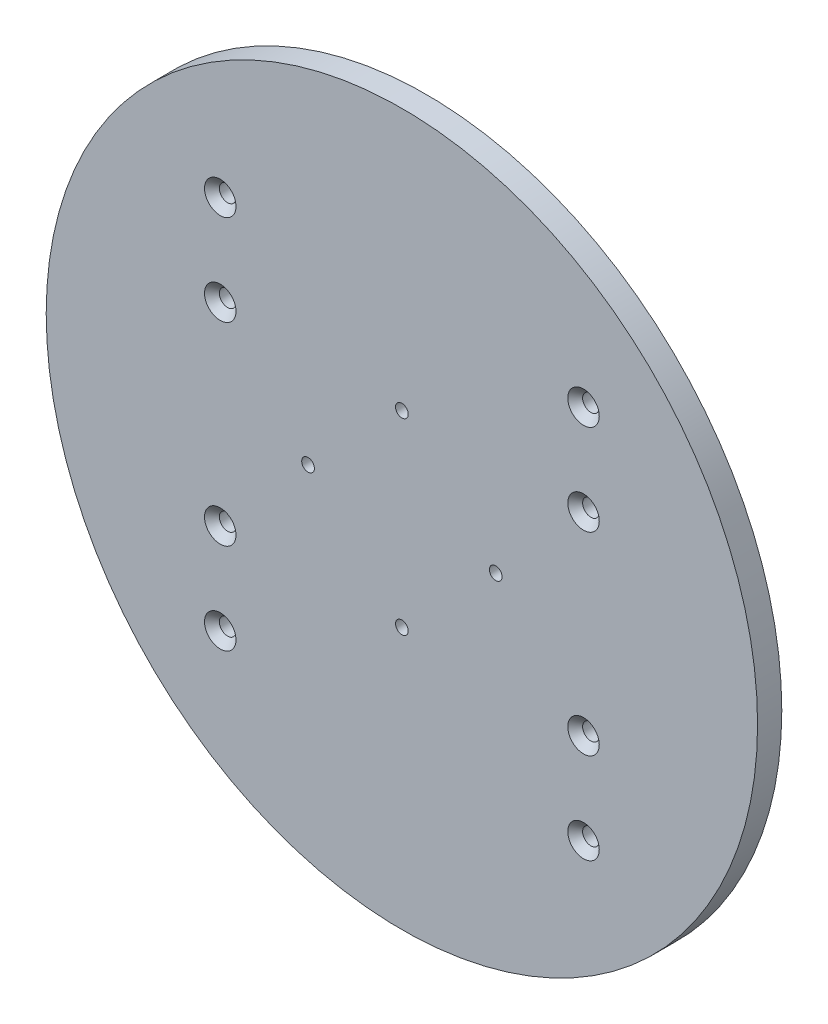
from build123d import *

# Parameters (mm, degrees)
SZKIC1_R                                             = 117.5
DODANIE_WYCI_GNI_CIE1_DEPTH                          = 8
POG_BIENIE_STO_KOWE_POD_M5_WKR_T_DO_CZ_C_D           = 5.5
POG_BIENIE_STO_KOWE_POD_M5_WKR_T_DO_CZ_C_CSINK_D     = 10.4
POG_BIENIE_STO_KOWE_POD_M5_WKR_T_DO_CZ_C_CSINK_ANGLE = 90
OTW_R_GWINTOWANY_M5X0_81_D                           = 4.2


with BuildPart() as part:
    # Szkic1 → Dodanie-wyci_gni_cie1 (new body)
    with BuildSketch(Plane.XY):
        Circle(SZKIC1_R)
    extrude(amount=DODANIE_WYCI_GNI_CIE1_DEPTH)

    # Pog_bienie sto_kowe pod M5 wkr_t do cz_c (through all)
    with Locations(Plane.XY.offset(8)):
        with Locations((-60, -32), (60, 32), (-60, 32), (60, -32), (-60, 62), (60, 62), (60, -62), (-60, -62)):
            CounterSinkHole(POG_BIENIE_STO_KOWE_POD_M5_WKR_T_DO_CZ_C_D / 2, POG_BIENIE_STO_KOWE_POD_M5_WKR_T_DO_CZ_C_CSINK_D / 2, counter_sink_angle=POG_BIENIE_STO_KOWE_POD_M5_WKR_T_DO_CZ_C_CSINK_ANGLE)

    # Otw_r gwintowany M5x0.81 (through all)
    with Locations(Plane.XY.offset(8)):
        with Locations((0, 31), (31, 0), (0, -31), (-31, 0)):
            Hole(OTW_R_GWINTOWANY_M5X0_81_D / 2)


solid = part.part
